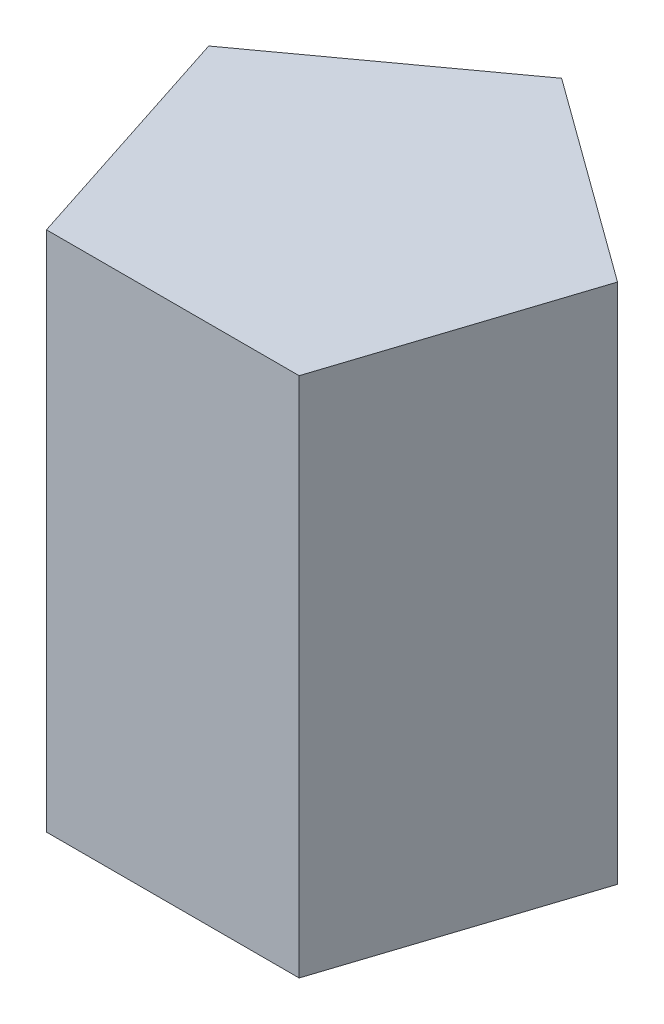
from build123d import *

# Parameters (mm, degrees)
EXTRUDE_4_DEPTH = 60


with BuildPart() as part:
    # Sketch 1 → Extrude 4 (new body)
    with BuildSketch(Plane(origin=(0, 0, 0), x_dir=(1, 0, 0), z_dir=(0, 1, 0))):
        Polygon((0, 24.72135955), (-23.511410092, 7.639320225), (-14.53085056, -20), (14.53085056, -20), (23.511410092, 7.639320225), align=None)
    extrude(amount=EXTRUDE_4_DEPTH)


solid = part.part
